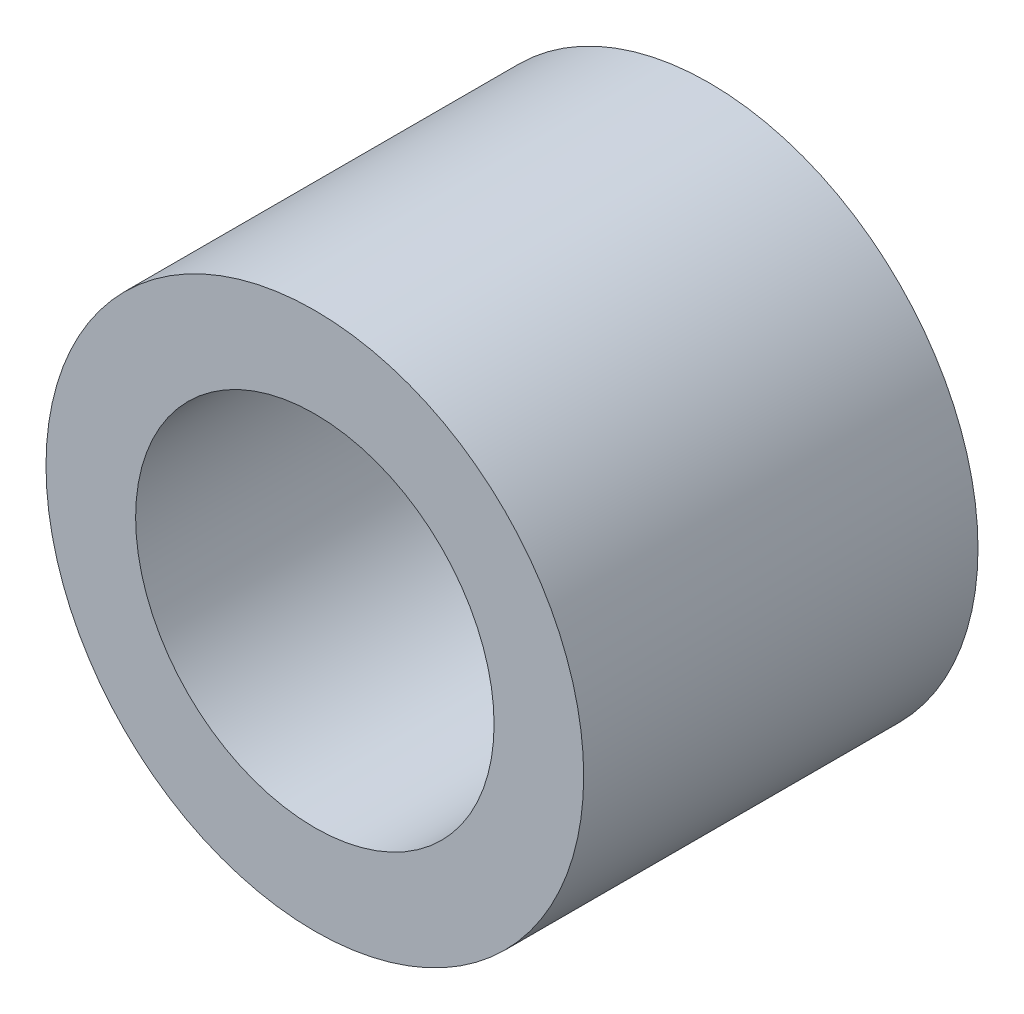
ISO-10303-21;
HEADER;
FILE_DESCRIPTION(('STEP AP214'),'2;1');
FILE_NAME('part.step','',(''),(''),'','','');
FILE_SCHEMA(('AUTOMOTIVE_DESIGN { 1 0 10303 214 1 1 1 1 }'));
ENDSEC;
DATA;
#1=APPLICATION_CONTEXT('core data for automotive mechanical design processes');
#2=APPLICATION_PROTOCOL_DEFINITION('international standard','automotive_design',2000,#1);
#3=PRODUCT_CONTEXT('',#1,'mechanical');
#4=PRODUCT('Part','Part','',(#3));
#5=PRODUCT_RELATED_PRODUCT_CATEGORY('part','',(#4));
#6=PRODUCT_DEFINITION_FORMATION('','',#4);
#7=PRODUCT_DEFINITION_CONTEXT('part definition',#1,'design');
#8=PRODUCT_DEFINITION('design','',#6,#7);
#9=PRODUCT_DEFINITION_SHAPE('','',#8);
#10=(LENGTH_UNIT() NAMED_UNIT(*) SI_UNIT(.MILLI.,.METRE.));
#11=(NAMED_UNIT(*) PLANE_ANGLE_UNIT() SI_UNIT($,.RADIAN.));
#12=(NAMED_UNIT(*) SI_UNIT($,.STERADIAN.) SOLID_ANGLE_UNIT());
#13=UNCERTAINTY_MEASURE_WITH_UNIT(LENGTH_MEASURE(1.E-05),#10,'distance_accuracy_value','');
#14=(GEOMETRIC_REPRESENTATION_CONTEXT(3) GLOBAL_UNCERTAINTY_ASSIGNED_CONTEXT((#13)) GLOBAL_UNIT_ASSIGNED_CONTEXT((#10,
#11,#12)) REPRESENTATION_CONTEXT('',''));
#15=CARTESIAN_POINT('',(0.,0.,0.));
#16=DIRECTION('',(0.,0.,1.));
#17=DIRECTION('',(1.,0.,0.));
#18=AXIS2_PLACEMENT_3D('',#15,#16,#17);
#19=CARTESIAN_POINT('',(0.,0.,11.));
#20=DIRECTION('',(0.,0.,1.));
#21=DIRECTION('',(1.,0.,0.));
#22=AXIS2_PLACEMENT_3D('',#19,#20,#21);
#23=PLANE('',#22);
#24=CARTESIAN_POINT('',(0.,0.,11.));
#25=DIRECTION('',(0.,0.,1.));
#26=DIRECTION('',(1.,0.,0.));
#27=AXIS2_PLACEMENT_3D('',#24,#25,#26);
#28=CIRCLE('',#27,7.5);
#29=CARTESIAN_POINT('',(7.5,0.,11.));
#30=VERTEX_POINT('',#29);
#31=EDGE_CURVE('E8',#30,#30,#28,.T.);
#32=ORIENTED_EDGE('',*,*,#31,.T.);
#33=EDGE_LOOP('',(#32));
#34=FACE_BOUND('',#33,.T.);
#35=CARTESIAN_POINT('',(0.,0.,11.));
#36=DIRECTION('',(0.,0.,1.));
#37=DIRECTION('',(1.,0.,0.));
#38=AXIS2_PLACEMENT_3D('',#35,#36,#37);
#39=CIRCLE('',#38,5.);
#40=CARTESIAN_POINT('',(5.,0.,11.));
#41=VERTEX_POINT('',#40);
#42=EDGE_CURVE('E23',#41,#41,#39,.T.);
#43=ORIENTED_EDGE('',*,*,#42,.F.);
#44=EDGE_LOOP('',(#43));
#45=FACE_BOUND('',#44,.T.);
#46=ADVANCED_FACE('F12',(#34,#45),#23,.T.);
#47=CARTESIAN_POINT('',(0.,0.,0.));
#48=DIRECTION('',(0.,0.,1.));
#49=DIRECTION('',(1.,0.,0.));
#50=AXIS2_PLACEMENT_3D('',#47,#48,#49);
#51=PLANE('',#50);
#52=CARTESIAN_POINT('',(0.,0.,0.));
#53=DIRECTION('',(0.,0.,1.));
#54=DIRECTION('',(1.,0.,0.));
#55=AXIS2_PLACEMENT_3D('',#52,#53,#54);
#56=CIRCLE('',#55,7.5);
#57=CARTESIAN_POINT('',(7.5,0.,0.));
#58=VERTEX_POINT('',#57);
#59=EDGE_CURVE('E16',#58,#58,#56,.T.);
#60=ORIENTED_EDGE('',*,*,#59,.F.);
#61=EDGE_LOOP('',(#60));
#62=FACE_BOUND('',#61,.T.);
#63=CARTESIAN_POINT('',(0.,0.,0.));
#64=DIRECTION('',(0.,0.,1.));
#65=DIRECTION('',(1.,0.,0.));
#66=AXIS2_PLACEMENT_3D('',#63,#64,#65);
#67=CIRCLE('',#66,5.);
#68=CARTESIAN_POINT('',(5.,0.,0.));
#69=VERTEX_POINT('',#68);
#70=EDGE_CURVE('E25',#69,#69,#67,.T.);
#71=ORIENTED_EDGE('',*,*,#70,.T.);
#72=EDGE_LOOP('',(#71));
#73=FACE_BOUND('',#72,.T.);
#74=ADVANCED_FACE('F35',(#62,#73),#51,.F.);
#75=CARTESIAN_POINT('',(0.,0.,11.));
#76=DIRECTION('',(0.,0.,-1.));
#77=DIRECTION('',(-1.,0.,0.));
#78=AXIS2_PLACEMENT_3D('',#75,#76,#77);
#79=CYLINDRICAL_SURFACE('',#78,7.5);
#80=ORIENTED_EDGE('',*,*,#31,.F.);
#81=EDGE_LOOP('',(#80));
#82=FACE_BOUND('',#81,.T.);
#83=ORIENTED_EDGE('',*,*,#59,.T.);
#84=EDGE_LOOP('',(#83));
#85=FACE_BOUND('',#84,.T.);
#86=ADVANCED_FACE('F14',(#82,#85),#79,.T.);
#87=CARTESIAN_POINT('',(0.,0.,11.));
#88=DIRECTION('',(0.,0.,-1.));
#89=DIRECTION('',(-1.,0.,0.));
#90=AXIS2_PLACEMENT_3D('',#87,#88,#89);
#91=CYLINDRICAL_SURFACE('',#90,5.);
#92=ORIENTED_EDGE('',*,*,#42,.T.);
#93=EDGE_LOOP('',(#92));
#94=FACE_BOUND('',#93,.T.);
#95=ORIENTED_EDGE('',*,*,#70,.F.);
#96=EDGE_LOOP('',(#95));
#97=FACE_BOUND('',#96,.T.);
#98=ADVANCED_FACE('F31',(#94,#97),#91,.F.);
#99=CLOSED_SHELL('',(#46,#74,#86,#98));
#100=MANIFOLD_SOLID_BREP('B1',#99);
#101=ADVANCED_BREP_SHAPE_REPRESENTATION('',(#18,#100),#14);
#102=SHAPE_DEFINITION_REPRESENTATION(#9,#101);
ENDSEC;
END-ISO-10303-21;
